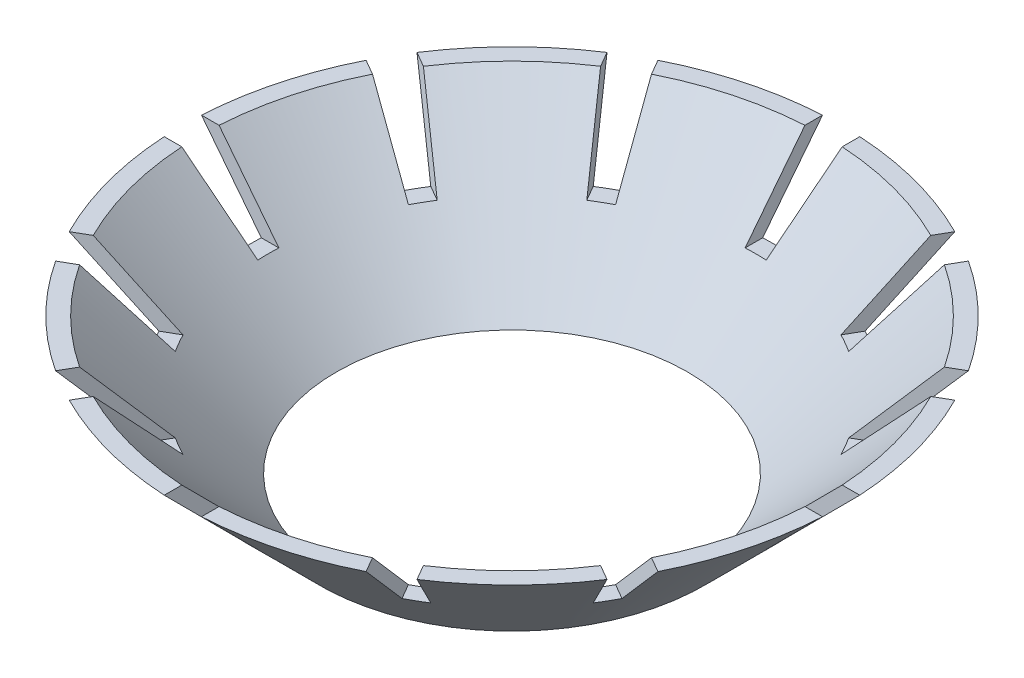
from build123d import *

# Parameters (mm, degrees)
CUT_EXTRUDE1_DEPTH = 24.500448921
CIRPATTERN1_COUNT  = 12


with BuildPart() as part:
    # Sketch1 → Base-Revolve (revolve)
    with BuildSketch(Plane(origin=(0, 0, 0), x_dir=(0, 0, -1), z_dir=(1, 0, 0))):
        Polygon((8.5, 0), (15.1, 6.6), (15.948528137, 6.6), (9.348528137, 0), align=None)
    revolve(axis=Axis((0, -30, 0), (0, 1, 0)))

    # Sketch2 → Cut-Extrude1 (cut, through all)
    with BuildSketch(Plane.XY):
        Polygon((-0.51, 3.3), (0.51, 3.3), (1.02, 7.6), (-1.02, 7.6), align=None)
    cut_extrude1 = extrude(amount=-CUT_EXTRUDE1_DEPTH, mode=Mode.SUBTRACT)

    # CirPattern1: Cut-Extrude1 ×12 about axis
    cirpattern1_axis = Axis((0, 0, 0), (0, 1, 0))
    for i in range(1, CIRPATTERN1_COUNT):
        add(cut_extrude1.rotate(cirpattern1_axis, i * 360 / CIRPATTERN1_COUNT), mode=Mode.SUBTRACT)


solid = part.part
